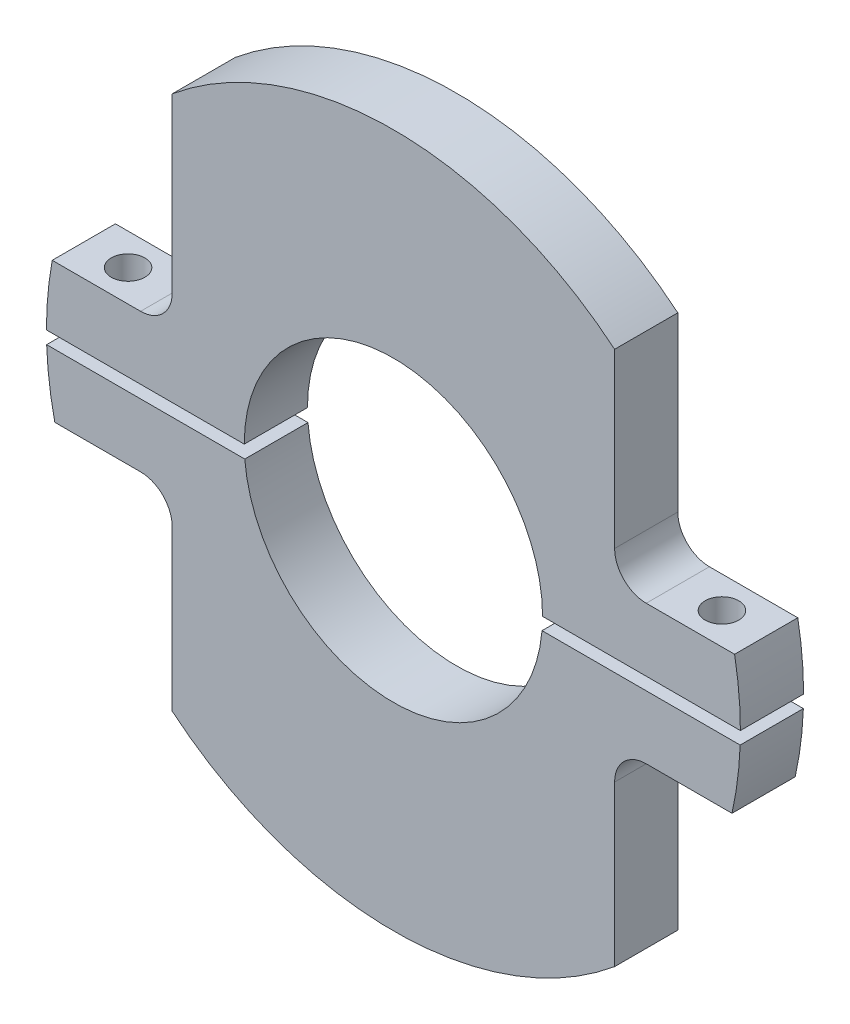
ISO-10303-21;
HEADER;
FILE_DESCRIPTION(('STEP AP214'),'2;1');
FILE_NAME('part.step','',(''),(''),'','','');
FILE_SCHEMA(('AUTOMOTIVE_DESIGN { 1 0 10303 214 1 1 1 1 }'));
ENDSEC;
DATA;
#1=APPLICATION_CONTEXT('core data for automotive mechanical design processes');
#2=APPLICATION_PROTOCOL_DEFINITION('international standard','automotive_design',2000,#1);
#3=PRODUCT_CONTEXT('',#1,'mechanical');
#4=PRODUCT('Part','Part','',(#3));
#5=PRODUCT_RELATED_PRODUCT_CATEGORY('part','',(#4));
#6=PRODUCT_DEFINITION_FORMATION('','',#4);
#7=PRODUCT_DEFINITION_CONTEXT('part definition',#1,'design');
#8=PRODUCT_DEFINITION('design','',#6,#7);
#9=PRODUCT_DEFINITION_SHAPE('','',#8);
#10=(LENGTH_UNIT() NAMED_UNIT(*) SI_UNIT(.MILLI.,.METRE.));
#11=(NAMED_UNIT(*) PLANE_ANGLE_UNIT() SI_UNIT($,.RADIAN.));
#12=(NAMED_UNIT(*) SI_UNIT($,.STERADIAN.) SOLID_ANGLE_UNIT());
#13=UNCERTAINTY_MEASURE_WITH_UNIT(LENGTH_MEASURE(1.E-05),#10,'distance_accuracy_value','');
#14=(GEOMETRIC_REPRESENTATION_CONTEXT(3) GLOBAL_UNCERTAINTY_ASSIGNED_CONTEXT((#13)) GLOBAL_UNIT_ASSIGNED_CONTEXT((#10,
#11,#12)) REPRESENTATION_CONTEXT('',''));
#15=CARTESIAN_POINT('',(0.,0.,0.));
#16=DIRECTION('',(0.,0.,1.));
#17=DIRECTION('',(1.,0.,0.));
#18=AXIS2_PLACEMENT_3D('',#15,#16,#17);
#19=CARTESIAN_POINT('',(0.,0.,12.7));
#20=DIRECTION('',(0.,0.,1.));
#21=DIRECTION('',(1.,0.,0.));
#22=AXIS2_PLACEMENT_3D('',#19,#20,#21);
#23=PLANE('',#22);
#24=DIRECTION('',(-1.,0.,0.));
#25=VECTOR('',#24,1.);
#26=CARTESIAN_POINT('',(-79.2624113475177,0.,12.7));
#27=LINE('',#26,#25);
#28=CARTESIAN_POINT('',(69.723,0.,12.7));
#29=VERTEX_POINT('',#28);
#30=CARTESIAN_POINT('',(29.972,0.,12.7));
#31=VERTEX_POINT('',#30);
#32=EDGE_CURVE('E187',#29,#31,#27,.T.);
#33=ORIENTED_EDGE('',*,*,#32,.F.);
#34=CARTESIAN_POINT('',(0.,0.,12.7));
#35=DIRECTION('',(0.,0.,1.));
#36=DIRECTION('',(1.,0.,0.));
#37=AXIS2_PLACEMENT_3D('',#34,#35,#36);
#38=CIRCLE('',#37,69.723);
#39=CARTESIAN_POINT('',(68.5565950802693,12.7,12.7));
#40=VERTEX_POINT('',#39);
#41=EDGE_CURVE('E223',#29,#40,#38,.T.);
#42=ORIENTED_EDGE('',*,*,#41,.T.);
#43=DIRECTION('',(1.,0.,0.));
#44=VECTOR('',#43,1.);
#45=CARTESIAN_POINT('',(89.9958628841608,12.7,12.7));
#46=LINE('',#45,#44);
#47=CARTESIAN_POINT('',(50.8,12.7,12.7));
#48=VERTEX_POINT('',#47);
#49=EDGE_CURVE('E198',#48,#40,#46,.T.);
#50=ORIENTED_EDGE('',*,*,#49,.F.);
#51=CARTESIAN_POINT('',(50.8,19.05,12.7));
#52=DIRECTION('',(0.,0.,1.));
#53=DIRECTION('',(1.,0.,0.));
#54=AXIS2_PLACEMENT_3D('',#51,#52,#53);
#55=CIRCLE('',#54,6.35);
#56=CARTESIAN_POINT('',(44.45,19.05,12.7));
#57=VERTEX_POINT('',#56);
#58=EDGE_CURVE('E53',#57,#48,#55,.T.);
#59=ORIENTED_EDGE('',*,*,#58,.F.);
#60=DIRECTION('',(0.,-1.,0.));
#61=VECTOR('',#60,1.);
#62=CARTESIAN_POINT('',(44.45,19.05,12.7));
#63=LINE('',#62,#61);
#64=CARTESIAN_POINT('',(44.45,53.716796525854,12.7));
#65=VERTEX_POINT('',#64);
#66=EDGE_CURVE('E215',#65,#57,#63,.T.);
#67=ORIENTED_EDGE('',*,*,#66,.F.);
#68=CARTESIAN_POINT('',(-44.45,53.716796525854,12.7));
#69=VERTEX_POINT('',#68);
#70=EDGE_CURVE('E225',#65,#69,#38,.T.);
#71=ORIENTED_EDGE('',*,*,#70,.T.);
#72=DIRECTION('',(0.,1.,0.));
#73=VECTOR('',#72,1.);
#74=CARTESIAN_POINT('',(-44.45,19.05,12.7));
#75=LINE('',#74,#73);
#76=CARTESIAN_POINT('',(-44.45,19.05,12.7));
#77=VERTEX_POINT('',#76);
#78=EDGE_CURVE('E195',#77,#69,#75,.T.);
#79=ORIENTED_EDGE('',*,*,#78,.F.);
#80=CARTESIAN_POINT('',(-50.8,19.05,12.7));
#81=DIRECTION('',(0.,0.,1.));
#82=DIRECTION('',(-1.,0.,0.));
#83=AXIS2_PLACEMENT_3D('',#80,#81,#82);
#84=CIRCLE('',#83,6.35);
#85=CARTESIAN_POINT('',(-50.8,12.7,12.7));
#86=VERTEX_POINT('',#85);
#87=EDGE_CURVE('E194',#86,#77,#84,.T.);
#88=ORIENTED_EDGE('',*,*,#87,.F.);
#89=DIRECTION('',(1.,0.,0.));
#90=VECTOR('',#89,1.);
#91=CARTESIAN_POINT('',(-79.2624113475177,12.7,12.7));
#92=LINE('',#91,#90);
#93=CARTESIAN_POINT('',(-68.5565950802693,12.7,12.7));
#94=VERTEX_POINT('',#93);
#95=EDGE_CURVE('E219',#94,#86,#92,.T.);
#96=ORIENTED_EDGE('',*,*,#95,.F.);
#97=CARTESIAN_POINT('',(-69.723,0.,12.7));
#98=VERTEX_POINT('',#97);
#99=EDGE_CURVE('E227',#94,#98,#38,.T.);
#100=ORIENTED_EDGE('',*,*,#99,.T.);
#101=CARTESIAN_POINT('',(-29.972,0.,12.7));
#102=VERTEX_POINT('',#101);
#103=EDGE_CURVE('E144',#102,#98,#27,.T.);
#104=ORIENTED_EDGE('',*,*,#103,.F.);
#105=CARTESIAN_POINT('',(0.,0.,12.7));
#106=DIRECTION('',(0.,0.,1.));
#107=DIRECTION('',(1.,0.,0.));
#108=AXIS2_PLACEMENT_3D('',#105,#106,#107);
#109=CIRCLE('',#108,29.972);
#110=EDGE_CURVE('E178',#31,#102,#109,.T.);
#111=ORIENTED_EDGE('',*,*,#110,.F.);
#112=EDGE_LOOP('',(#33,#42,#50,#59,#67,#71,#79,#88,#96,#100,#104,#111));
#113=FACE_BOUND('',#112,.T.);
#114=ADVANCED_FACE('F44',(#113),#23,.T.);
#115=CARTESIAN_POINT('',(0.,0.,0.));
#116=DIRECTION('',(0.,0.,1.));
#117=DIRECTION('',(1.,0.,0.));
#118=AXIS2_PLACEMENT_3D('',#115,#116,#117);
#119=PLANE('',#118);
#120=CARTESIAN_POINT('',(0.,0.,0.));
#121=DIRECTION('',(0.,0.,1.));
#122=DIRECTION('',(1.,0.,0.));
#123=AXIS2_PLACEMENT_3D('',#120,#121,#122);
#124=CIRCLE('',#123,69.723);
#125=CARTESIAN_POINT('',(69.723,0.,0.));
#126=VERTEX_POINT('',#125);
#127=CARTESIAN_POINT('',(68.5565950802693,12.7,0.));
#128=VERTEX_POINT('',#127);
#129=EDGE_CURVE('E165',#126,#128,#124,.T.);
#130=ORIENTED_EDGE('',*,*,#129,.F.);
#131=DIRECTION('',(-1.,0.,0.));
#132=VECTOR('',#131,1.);
#133=CARTESIAN_POINT('',(-79.2624113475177,0.,0.));
#134=LINE('',#133,#132);
#135=CARTESIAN_POINT('',(29.972,0.,0.));
#136=VERTEX_POINT('',#135);
#137=EDGE_CURVE('E110',#126,#136,#134,.T.);
#138=ORIENTED_EDGE('',*,*,#137,.T.);
#139=CARTESIAN_POINT('',(0.,0.,0.));
#140=DIRECTION('',(0.,0.,1.));
#141=DIRECTION('',(1.,0.,0.));
#142=AXIS2_PLACEMENT_3D('',#139,#140,#141);
#143=CIRCLE('',#142,29.972);
#144=CARTESIAN_POINT('',(-29.972,0.,0.));
#145=VERTEX_POINT('',#144);
#146=EDGE_CURVE('E47',#136,#145,#143,.T.);
#147=ORIENTED_EDGE('',*,*,#146,.T.);
#148=CARTESIAN_POINT('',(-69.723,0.,0.));
#149=VERTEX_POINT('',#148);
#150=EDGE_CURVE('E133',#145,#149,#134,.T.);
#151=ORIENTED_EDGE('',*,*,#150,.T.);
#152=CARTESIAN_POINT('',(-68.5565950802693,12.7,0.));
#153=VERTEX_POINT('',#152);
#154=EDGE_CURVE('E150',#153,#149,#124,.T.);
#155=ORIENTED_EDGE('',*,*,#154,.F.);
#156=DIRECTION('',(1.,0.,0.));
#157=VECTOR('',#156,1.);
#158=CARTESIAN_POINT('',(-79.2624113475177,12.7,0.));
#159=LINE('',#158,#157);
#160=CARTESIAN_POINT('',(-50.8,12.7,0.));
#161=VERTEX_POINT('',#160);
#162=EDGE_CURVE('E159',#153,#161,#159,.T.);
#163=ORIENTED_EDGE('',*,*,#162,.T.);
#164=CARTESIAN_POINT('',(-50.8,19.05,0.));
#165=DIRECTION('',(0.,0.,1.));
#166=DIRECTION('',(-1.,0.,0.));
#167=AXIS2_PLACEMENT_3D('',#164,#165,#166);
#168=CIRCLE('',#167,6.35);
#169=CARTESIAN_POINT('',(-44.45,19.05,0.));
#170=VERTEX_POINT('',#169);
#171=EDGE_CURVE('E210',#161,#170,#168,.T.);
#172=ORIENTED_EDGE('',*,*,#171,.T.);
#173=DIRECTION('',(0.,1.,0.));
#174=VECTOR('',#173,1.);
#175=CARTESIAN_POINT('',(-44.45,19.05,0.));
#176=LINE('',#175,#174);
#177=CARTESIAN_POINT('',(-44.45,53.716796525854,0.));
#178=VERTEX_POINT('',#177);
#179=EDGE_CURVE('E207',#170,#178,#176,.T.);
#180=ORIENTED_EDGE('',*,*,#179,.T.);
#181=CARTESIAN_POINT('',(44.45,53.716796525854,0.));
#182=VERTEX_POINT('',#181);
#183=EDGE_CURVE('E166',#182,#178,#124,.T.);
#184=ORIENTED_EDGE('',*,*,#183,.F.);
#185=DIRECTION('',(0.,-1.,0.));
#186=VECTOR('',#185,1.);
#187=CARTESIAN_POINT('',(44.45,19.05,0.));
#188=LINE('',#187,#186);
#189=CARTESIAN_POINT('',(44.45,19.05,0.));
#190=VERTEX_POINT('',#189);
#191=EDGE_CURVE('E204',#182,#190,#188,.T.);
#192=ORIENTED_EDGE('',*,*,#191,.T.);
#193=CARTESIAN_POINT('',(50.8,19.05,0.));
#194=DIRECTION('',(0.,0.,1.));
#195=DIRECTION('',(1.,0.,0.));
#196=AXIS2_PLACEMENT_3D('',#193,#194,#195);
#197=CIRCLE('',#196,6.35);
#198=CARTESIAN_POINT('',(50.8,12.7,0.));
#199=VERTEX_POINT('',#198);
#200=EDGE_CURVE('E201',#190,#199,#197,.T.);
#201=ORIENTED_EDGE('',*,*,#200,.T.);
#202=DIRECTION('',(1.,0.,0.));
#203=VECTOR('',#202,1.);
#204=CARTESIAN_POINT('',(89.9958628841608,12.7,0.));
#205=LINE('',#204,#203);
#206=EDGE_CURVE('E189',#199,#128,#205,.T.);
#207=ORIENTED_EDGE('',*,*,#206,.T.);
#208=EDGE_LOOP('',(#130,#138,#147,#151,#155,#163,#172,#180,#184,#192,#201,#207));
#209=FACE_BOUND('',#208,.T.);
#210=ADVANCED_FACE('F156',(#209),#119,.F.);
#211=CARTESIAN_POINT('',(0.,0.,12.7));
#212=DIRECTION('',(0.,0.,-1.));
#213=DIRECTION('',(-1.,0.,0.));
#214=AXIS2_PLACEMENT_3D('',#211,#212,#213);
#215=CYLINDRICAL_SURFACE('',#214,69.723);
#216=ORIENTED_EDGE('',*,*,#41,.F.);
#217=DIRECTION('',(0.,0.,-1.));
#218=VECTOR('',#217,1.);
#219=CARTESIAN_POINT('',(69.723,0.,12.7));
#220=LINE('',#219,#218);
#221=EDGE_CURVE('E104',#29,#126,#220,.T.);
#222=ORIENTED_EDGE('',*,*,#221,.T.);
#223=ORIENTED_EDGE('',*,*,#129,.T.);
#224=DIRECTION('',(0.,0.,-1.));
#225=VECTOR('',#224,1.);
#226=CARTESIAN_POINT('',(68.5565950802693,12.7,12.7));
#227=LINE('',#226,#225);
#228=EDGE_CURVE('E163',#128,#40,#227,.F.);
#229=ORIENTED_EDGE('',*,*,#228,.T.);
#230=EDGE_LOOP('',(#216,#222,#223,#229));
#231=FACE_BOUND('',#230,.T.);
#232=ADVANCED_FACE('F241',(#231),#215,.T.);
#233=ORIENTED_EDGE('',*,*,#154,.T.);
#234=DIRECTION('',(0.,0.,-1.));
#235=VECTOR('',#234,1.);
#236=CARTESIAN_POINT('',(-69.723,0.,12.7));
#237=LINE('',#236,#235);
#238=EDGE_CURVE('E142',#149,#98,#237,.F.);
#239=ORIENTED_EDGE('',*,*,#238,.T.);
#240=ORIENTED_EDGE('',*,*,#99,.F.);
#241=DIRECTION('',(0.,0.,-1.));
#242=VECTOR('',#241,1.);
#243=CARTESIAN_POINT('',(-68.5565950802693,12.7,12.7));
#244=LINE('',#243,#242);
#245=EDGE_CURVE('E149',#94,#153,#244,.T.);
#246=ORIENTED_EDGE('',*,*,#245,.T.);
#247=EDGE_LOOP('',(#233,#239,#240,#246));
#248=FACE_BOUND('',#247,.T.);
#249=ADVANCED_FACE('F162',(#248),#215,.T.);
#250=ORIENTED_EDGE('',*,*,#70,.F.);
#251=DIRECTION('',(0.,0.,-1.));
#252=VECTOR('',#251,1.);
#253=CARTESIAN_POINT('',(44.45,53.716796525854,12.7));
#254=LINE('',#253,#252);
#255=EDGE_CURVE('E173',#65,#182,#254,.T.);
#256=ORIENTED_EDGE('',*,*,#255,.T.);
#257=ORIENTED_EDGE('',*,*,#183,.T.);
#258=DIRECTION('',(0.,0.,-1.));
#259=VECTOR('',#258,1.);
#260=CARTESIAN_POINT('',(-44.45,53.716796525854,12.7));
#261=LINE('',#260,#259);
#262=EDGE_CURVE('E172',#178,#69,#261,.F.);
#263=ORIENTED_EDGE('',*,*,#262,.T.);
#264=EDGE_LOOP('',(#250,#256,#257,#263));
#265=FACE_BOUND('',#264,.T.);
#266=ADVANCED_FACE('F250',(#265),#215,.T.);
#267=CARTESIAN_POINT('',(0.,0.,12.7));
#268=DIRECTION('',(0.,0.,-1.));
#269=DIRECTION('',(-1.,0.,0.));
#270=AXIS2_PLACEMENT_3D('',#267,#268,#269);
#271=CYLINDRICAL_SURFACE('',#270,29.972);
#272=DIRECTION('',(0.,0.,-1.));
#273=VECTOR('',#272,1.);
#274=CARTESIAN_POINT('',(29.972,0.,12.7));
#275=LINE('',#274,#273);
#276=EDGE_CURVE('E185',#31,#136,#275,.T.);
#277=ORIENTED_EDGE('',*,*,#276,.F.);
#278=ORIENTED_EDGE('',*,*,#110,.T.);
#279=DIRECTION('',(0.,0.,-1.));
#280=VECTOR('',#279,1.);
#281=CARTESIAN_POINT('',(-29.972,0.,12.7));
#282=LINE('',#281,#280);
#283=EDGE_CURVE('E128',#145,#102,#282,.F.);
#284=ORIENTED_EDGE('',*,*,#283,.F.);
#285=ORIENTED_EDGE('',*,*,#146,.F.);
#286=EDGE_LOOP('',(#277,#278,#284,#285));
#287=FACE_BOUND('',#286,.T.);
#288=ADVANCED_FACE('F237',(#287),#271,.F.);
#289=CARTESIAN_POINT('',(-79.2624113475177,0.,0.));
#290=DIRECTION('',(0.,1.,0.));
#291=DIRECTION('',(0.,0.,1.));
#292=AXIS2_PLACEMENT_3D('',#289,#290,#291);
#293=PLANE('',#292);
#294=CARTESIAN_POINT('',(-59.6665950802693,0.,6.35));
#295=DIRECTION('',(0.,1.,0.));
#296=DIRECTION('',(0.,0.,1.));
#297=AXIS2_PLACEMENT_3D('',#294,#295,#296);
#298=CIRCLE('',#297,3.37819999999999);
#299=CARTESIAN_POINT('',(-59.6665950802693,0.,9.72819999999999));
#300=VERTEX_POINT('',#299);
#301=EDGE_CURVE('E226',#300,#300,#298,.T.);
#302=ORIENTED_EDGE('',*,*,#301,.T.);
#303=EDGE_LOOP('',(#302));
#304=FACE_BOUND('',#303,.T.);
#305=ORIENTED_EDGE('',*,*,#150,.F.);
#306=ORIENTED_EDGE('',*,*,#283,.T.);
#307=ORIENTED_EDGE('',*,*,#103,.T.);
#308=ORIENTED_EDGE('',*,*,#238,.F.);
#309=EDGE_LOOP('',(#305,#306,#307,#308));
#310=FACE_BOUND('',#309,.T.);
#311=ADVANCED_FACE('F143',(#304,#310),#293,.F.);
#312=CARTESIAN_POINT('',(59.6665950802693,0.,6.35));
#313=DIRECTION('',(0.,1.,0.));
#314=DIRECTION('',(0.,0.,1.));
#315=AXIS2_PLACEMENT_3D('',#312,#313,#314);
#316=CIRCLE('',#315,3.3782);
#317=CARTESIAN_POINT('',(59.6665950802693,0.,9.7282));
#318=VERTEX_POINT('',#317);
#319=EDGE_CURVE('E396',#318,#318,#316,.T.);
#320=ORIENTED_EDGE('',*,*,#319,.T.);
#321=EDGE_LOOP('',(#320));
#322=FACE_BOUND('',#321,.T.);
#323=ORIENTED_EDGE('',*,*,#32,.T.);
#324=ORIENTED_EDGE('',*,*,#276,.T.);
#325=ORIENTED_EDGE('',*,*,#137,.F.);
#326=ORIENTED_EDGE('',*,*,#221,.F.);
#327=EDGE_LOOP('',(#323,#324,#325,#326));
#328=FACE_BOUND('',#327,.T.);
#329=ADVANCED_FACE('F267',(#322,#328),#293,.F.);
#330=CARTESIAN_POINT('',(-44.45,19.05,0.));
#331=DIRECTION('',(1.,0.,0.));
#332=DIRECTION('',(0.,0.,-1.));
#333=AXIS2_PLACEMENT_3D('',#330,#331,#332);
#334=PLANE('',#333);
#335=ORIENTED_EDGE('',*,*,#179,.F.);
#336=DIRECTION('',(0.,0.,1.));
#337=VECTOR('',#336,1.);
#338=CARTESIAN_POINT('',(-44.45,19.05,0.));
#339=LINE('',#338,#337);
#340=EDGE_CURVE('E94',#170,#77,#339,.T.);
#341=ORIENTED_EDGE('',*,*,#340,.T.);
#342=ORIENTED_EDGE('',*,*,#78,.T.);
#343=ORIENTED_EDGE('',*,*,#262,.F.);
#344=EDGE_LOOP('',(#335,#341,#342,#343));
#345=FACE_BOUND('',#344,.T.);
#346=ADVANCED_FACE('F251',(#345),#334,.F.);
#347=CARTESIAN_POINT('',(-79.2624113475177,12.7,0.));
#348=DIRECTION('',(0.,-1.,0.));
#349=DIRECTION('',(0.,0.,-1.));
#350=AXIS2_PLACEMENT_3D('',#347,#348,#349);
#351=PLANE('',#350);
#352=CARTESIAN_POINT('',(-59.6665950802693,12.7,6.35));
#353=DIRECTION('',(0.,1.,0.));
#354=DIRECTION('',(0.,0.,1.));
#355=AXIS2_PLACEMENT_3D('',#352,#353,#354);
#356=CIRCLE('',#355,3.37819999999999);
#357=CARTESIAN_POINT('',(-59.6665950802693,12.7,9.72819999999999));
#358=VERTEX_POINT('',#357);
#359=EDGE_CURVE('E233',#358,#358,#356,.T.);
#360=ORIENTED_EDGE('',*,*,#359,.F.);
#361=EDGE_LOOP('',(#360));
#362=FACE_BOUND('',#361,.T.);
#363=ORIENTED_EDGE('',*,*,#95,.T.);
#364=DIRECTION('',(0.,0.,1.));
#365=VECTOR('',#364,1.);
#366=CARTESIAN_POINT('',(-50.8,12.7,0.));
#367=LINE('',#366,#365);
#368=EDGE_CURVE('E191',#161,#86,#367,.T.);
#369=ORIENTED_EDGE('',*,*,#368,.F.);
#370=ORIENTED_EDGE('',*,*,#162,.F.);
#371=ORIENTED_EDGE('',*,*,#245,.F.);
#372=EDGE_LOOP('',(#363,#369,#370,#371));
#373=FACE_BOUND('',#372,.T.);
#374=ADVANCED_FACE('F258',(#362,#373),#351,.F.);
#375=CARTESIAN_POINT('',(-50.8,19.05,0.));
#376=DIRECTION('',(0.,0.,1.));
#377=DIRECTION('',(1.,0.,0.));
#378=AXIS2_PLACEMENT_3D('',#375,#376,#377);
#379=CYLINDRICAL_SURFACE('',#378,6.35);
#380=ORIENTED_EDGE('',*,*,#87,.T.);
#381=ORIENTED_EDGE('',*,*,#340,.F.);
#382=ORIENTED_EDGE('',*,*,#171,.F.);
#383=ORIENTED_EDGE('',*,*,#368,.T.);
#384=EDGE_LOOP('',(#380,#381,#382,#383));
#385=FACE_BOUND('',#384,.T.);
#386=ADVANCED_FACE('F255',(#385),#379,.F.);
#387=CARTESIAN_POINT('',(89.9958628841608,12.7,0.));
#388=DIRECTION('',(0.,-1.,0.));
#389=DIRECTION('',(1.,0.,0.));
#390=AXIS2_PLACEMENT_3D('',#387,#388,#389);
#391=PLANE('',#390);
#392=CARTESIAN_POINT('',(59.6665950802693,12.7,6.35));
#393=DIRECTION('',(0.,1.,0.));
#394=DIRECTION('',(0.,0.,1.));
#395=AXIS2_PLACEMENT_3D('',#392,#393,#394);
#396=CIRCLE('',#395,3.3782);
#397=CARTESIAN_POINT('',(59.6665950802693,12.7,9.7282));
#398=VERTEX_POINT('',#397);
#399=EDGE_CURVE('E398',#398,#398,#396,.T.);
#400=ORIENTED_EDGE('',*,*,#399,.F.);
#401=EDGE_LOOP('',(#400));
#402=FACE_BOUND('',#401,.T.);
#403=ORIENTED_EDGE('',*,*,#206,.F.);
#404=DIRECTION('',(0.,0.,1.));
#405=VECTOR('',#404,1.);
#406=CARTESIAN_POINT('',(50.8,12.7,0.));
#407=LINE('',#406,#405);
#408=EDGE_CURVE('E62',#199,#48,#407,.T.);
#409=ORIENTED_EDGE('',*,*,#408,.T.);
#410=ORIENTED_EDGE('',*,*,#49,.T.);
#411=ORIENTED_EDGE('',*,*,#228,.F.);
#412=EDGE_LOOP('',(#403,#409,#410,#411));
#413=FACE_BOUND('',#412,.T.);
#414=ADVANCED_FACE('F243',(#402,#413),#391,.F.);
#415=CARTESIAN_POINT('',(44.45,19.05,0.));
#416=DIRECTION('',(-1.,0.,0.));
#417=DIRECTION('',(0.,0.,1.));
#418=AXIS2_PLACEMENT_3D('',#415,#416,#417);
#419=PLANE('',#418);
#420=ORIENTED_EDGE('',*,*,#66,.T.);
#421=DIRECTION('',(0.,0.,1.));
#422=VECTOR('',#421,1.);
#423=CARTESIAN_POINT('',(44.45,19.05,0.));
#424=LINE('',#423,#422);
#425=EDGE_CURVE('E12',#190,#57,#424,.T.);
#426=ORIENTED_EDGE('',*,*,#425,.F.);
#427=ORIENTED_EDGE('',*,*,#191,.F.);
#428=ORIENTED_EDGE('',*,*,#255,.F.);
#429=EDGE_LOOP('',(#420,#426,#427,#428));
#430=FACE_BOUND('',#429,.T.);
#431=ADVANCED_FACE('F284',(#430),#419,.F.);
#432=CARTESIAN_POINT('',(50.8,19.05,0.));
#433=DIRECTION('',(0.,0.,1.));
#434=DIRECTION('',(1.,0.,0.));
#435=AXIS2_PLACEMENT_3D('',#432,#433,#434);
#436=CYLINDRICAL_SURFACE('',#435,6.35);
#437=ORIENTED_EDGE('',*,*,#58,.T.);
#438=ORIENTED_EDGE('',*,*,#408,.F.);
#439=ORIENTED_EDGE('',*,*,#200,.F.);
#440=ORIENTED_EDGE('',*,*,#425,.T.);
#441=EDGE_LOOP('',(#437,#438,#439,#440));
#442=FACE_BOUND('',#441,.T.);
#443=ADVANCED_FACE('F245',(#442),#436,.F.);
#444=CARTESIAN_POINT('',(-59.6665950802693,-69.723,6.35));
#445=DIRECTION('',(0.,1.,0.));
#446=DIRECTION('',(0.,0.,1.));
#447=AXIS2_PLACEMENT_3D('',#444,#445,#446);
#448=CYLINDRICAL_SURFACE('',#447,3.37819999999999);
#449=ORIENTED_EDGE('',*,*,#359,.T.);
#450=EDGE_LOOP('',(#449));
#451=FACE_BOUND('',#450,.T.);
#452=ORIENTED_EDGE('',*,*,#301,.F.);
#453=EDGE_LOOP('',(#452));
#454=FACE_BOUND('',#453,.T.);
#455=ADVANCED_FACE('F288',(#451,#454),#448,.F.);
#456=CARTESIAN_POINT('',(59.6665950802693,-69.723,6.35));
#457=DIRECTION('',(0.,1.,0.));
#458=DIRECTION('',(0.,0.,1.));
#459=AXIS2_PLACEMENT_3D('',#456,#457,#458);
#460=CYLINDRICAL_SURFACE('',#459,3.3782);
#461=ORIENTED_EDGE('',*,*,#399,.T.);
#462=EDGE_LOOP('',(#461));
#463=FACE_BOUND('',#462,.T.);
#464=ORIENTED_EDGE('',*,*,#319,.F.);
#465=EDGE_LOOP('',(#464));
#466=FACE_BOUND('',#465,.T.);
#467=ADVANCED_FACE('F306',(#463,#466),#460,.F.);
#468=CLOSED_SHELL('',(#114,#210,#232,#249,#266,#288,#311,#329,#346,#374,#386,#414,#431,#443,
#455,#467));
#469=MANIFOLD_SOLID_BREP('B2',#468);
#470=CARTESIAN_POINT('',(0.,0.,12.7));
#471=DIRECTION('',(0.,0.,-1.));
#472=DIRECTION('',(-1.,0.,0.));
#473=AXIS2_PLACEMENT_3D('',#470,#471,#472);
#474=CYLINDRICAL_SURFACE('',#473,69.723);
#475=CARTESIAN_POINT('',(0.,0.,12.7));
#476=DIRECTION('',(0.,0.,1.));
#477=DIRECTION('',(1.,0.,0.));
#478=AXIS2_PLACEMENT_3D('',#475,#476,#477);
#479=CIRCLE('',#478,69.723);
#480=CARTESIAN_POINT('',(68.0370423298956,-15.24,12.7));
#481=VERTEX_POINT('',#480);
#482=CARTESIAN_POINT('',(69.6767187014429,-2.54,12.7));
#483=VERTEX_POINT('',#482);
#484=EDGE_CURVE('E574',#481,#483,#479,.T.);
#485=ORIENTED_EDGE('',*,*,#484,.F.);
#486=DIRECTION('',(0.,0.,-1.));
#487=VECTOR('',#486,1.);
#488=CARTESIAN_POINT('',(68.0370423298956,-15.24,12.7));
#489=LINE('',#488,#487);
#490=CARTESIAN_POINT('',(68.0370423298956,-15.24,0.));
#491=VERTEX_POINT('',#490);
#492=EDGE_CURVE('E416',#481,#491,#489,.T.);
#493=ORIENTED_EDGE('',*,*,#492,.T.);
#494=CARTESIAN_POINT('',(0.,0.,0.));
#495=DIRECTION('',(0.,0.,1.));
#496=DIRECTION('',(1.,0.,0.));
#497=AXIS2_PLACEMENT_3D('',#494,#495,#496);
#498=CIRCLE('',#497,69.723);
#499=CARTESIAN_POINT('',(69.6767187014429,-2.54,0.));
#500=VERTEX_POINT('',#499);
#501=EDGE_CURVE('E569',#491,#500,#498,.T.);
#502=ORIENTED_EDGE('',*,*,#501,.T.);
#503=DIRECTION('',(0.,0.,-1.));
#504=VECTOR('',#503,1.);
#505=CARTESIAN_POINT('',(69.6767187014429,-2.54,12.7));
#506=LINE('',#505,#504);
#507=EDGE_CURVE('E553',#500,#483,#506,.F.);
#508=ORIENTED_EDGE('',*,*,#507,.T.);
#509=EDGE_LOOP('',(#485,#493,#502,#508));
#510=FACE_BOUND('',#509,.T.);
#511=ADVANCED_FACE('F408',(#510),#474,.T.);
#512=CARTESIAN_POINT('',(0.,0.,12.7));
#513=DIRECTION('',(0.,0.,-1.));
#514=DIRECTION('',(-1.,0.,0.));
#515=AXIS2_PLACEMENT_3D('',#512,#513,#514);
#516=CYLINDRICAL_SURFACE('',#515,29.972);
#517=DIRECTION('',(0.,0.,-1.));
#518=VECTOR('',#517,1.);
#519=CARTESIAN_POINT('',(-29.8641789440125,-2.54,12.7));
#520=LINE('',#519,#518);
#521=CARTESIAN_POINT('',(-29.8641789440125,-2.54,12.7));
#522=VERTEX_POINT('',#521);
#523=CARTESIAN_POINT('',(-29.8641789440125,-2.54,0.));
#524=VERTEX_POINT('',#523);
#525=EDGE_CURVE('E581',#522,#524,#520,.T.);
#526=ORIENTED_EDGE('',*,*,#525,.F.);
#527=CARTESIAN_POINT('',(0.,0.,12.7));
#528=DIRECTION('',(0.,0.,1.));
#529=DIRECTION('',(1.,0.,0.));
#530=AXIS2_PLACEMENT_3D('',#527,#528,#529);
#531=CIRCLE('',#530,29.972);
#532=CARTESIAN_POINT('',(29.8641789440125,-2.54,12.7));
#533=VERTEX_POINT('',#532);
#534=EDGE_CURVE('E566',#522,#533,#531,.T.);
#535=ORIENTED_EDGE('',*,*,#534,.T.);
#536=DIRECTION('',(0.,0.,-1.));
#537=VECTOR('',#536,1.);
#538=CARTESIAN_POINT('',(29.8641789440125,-2.54,12.7));
#539=LINE('',#538,#537);
#540=CARTESIAN_POINT('',(29.8641789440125,-2.54,0.));
#541=VERTEX_POINT('',#540);
#542=EDGE_CURVE('E579',#541,#533,#539,.F.);
#543=ORIENTED_EDGE('',*,*,#542,.F.);
#544=CARTESIAN_POINT('',(0.,0.,0.));
#545=DIRECTION('',(0.,0.,1.));
#546=DIRECTION('',(1.,0.,0.));
#547=AXIS2_PLACEMENT_3D('',#544,#545,#546);
#548=CIRCLE('',#547,29.972);
#549=EDGE_CURVE('E563',#524,#541,#548,.T.);
#550=ORIENTED_EDGE('',*,*,#549,.F.);
#551=EDGE_LOOP('',(#526,#535,#543,#550));
#552=FACE_BOUND('',#551,.T.);
#553=ADVANCED_FACE('F614',(#552),#516,.F.);
#554=CARTESIAN_POINT('',(-69.6767187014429,-2.54,12.7));
#555=VERTEX_POINT('',#554);
#556=CARTESIAN_POINT('',(-68.0370423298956,-15.24,12.7));
#557=VERTEX_POINT('',#556);
#558=EDGE_CURVE('E578',#555,#557,#479,.T.);
#559=ORIENTED_EDGE('',*,*,#558,.F.);
#560=DIRECTION('',(0.,0.,-1.));
#561=VECTOR('',#560,1.);
#562=CARTESIAN_POINT('',(-69.6767187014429,-2.54,12.7));
#563=LINE('',#562,#561);
#564=CARTESIAN_POINT('',(-69.6767187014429,-2.54,0.));
#565=VERTEX_POINT('',#564);
#566=EDGE_CURVE('E560',#555,#565,#563,.T.);
#567=ORIENTED_EDGE('',*,*,#566,.T.);
#568=CARTESIAN_POINT('',(-68.0370423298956,-15.24,0.));
#569=VERTEX_POINT('',#568);
#570=EDGE_CURVE('E573',#565,#569,#498,.T.);
#571=ORIENTED_EDGE('',*,*,#570,.T.);
#572=DIRECTION('',(0.,0.,-1.));
#573=VECTOR('',#572,1.);
#574=CARTESIAN_POINT('',(-68.0370423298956,-15.24,12.7));
#575=LINE('',#574,#573);
#576=EDGE_CURVE('E584',#569,#557,#575,.F.);
#577=ORIENTED_EDGE('',*,*,#576,.T.);
#578=EDGE_LOOP('',(#559,#567,#571,#577));
#579=FACE_BOUND('',#578,.T.);
#580=ADVANCED_FACE('F617',(#579),#474,.T.);
#581=CARTESIAN_POINT('',(-44.45,-53.716796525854,0.));
#582=VERTEX_POINT('',#581);
#583=CARTESIAN_POINT('',(44.45,-53.716796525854,0.));
#584=VERTEX_POINT('',#583);
#585=EDGE_CURVE('E572',#582,#584,#498,.T.);
#586=ORIENTED_EDGE('',*,*,#585,.T.);
#587=DIRECTION('',(0.,0.,-1.));
#588=VECTOR('',#587,1.);
#589=CARTESIAN_POINT('',(44.45,-53.716796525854,12.7));
#590=LINE('',#589,#588);
#591=CARTESIAN_POINT('',(44.45,-53.716796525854,12.7));
#592=VERTEX_POINT('',#591);
#593=EDGE_CURVE('E42',#584,#592,#590,.F.);
#594=ORIENTED_EDGE('',*,*,#593,.T.);
#595=CARTESIAN_POINT('',(-44.45,-53.716796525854,12.7));
#596=VERTEX_POINT('',#595);
#597=EDGE_CURVE('E577',#596,#592,#479,.T.);
#598=ORIENTED_EDGE('',*,*,#597,.F.);
#599=DIRECTION('',(0.,0.,-1.));
#600=VECTOR('',#599,1.);
#601=CARTESIAN_POINT('',(-44.45,-53.716796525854,12.7));
#602=LINE('',#601,#600);
#603=EDGE_CURVE('E501',#596,#582,#602,.T.);
#604=ORIENTED_EDGE('',*,*,#603,.T.);
#605=EDGE_LOOP('',(#586,#594,#598,#604));
#606=FACE_BOUND('',#605,.T.);
#607=ADVANCED_FACE('F616',(#606),#474,.T.);
#608=CARTESIAN_POINT('',(0.,0.,0.));
#609=DIRECTION('',(0.,0.,1.));
#610=DIRECTION('',(1.,0.,0.));
#611=AXIS2_PLACEMENT_3D('',#608,#609,#610);
#612=PLANE('',#611);
#613=CARTESIAN_POINT('',(50.8,-21.59,0.));
#614=DIRECTION('',(0.,0.,1.));
#615=DIRECTION('',(1.,0.,0.));
#616=AXIS2_PLACEMENT_3D('',#613,#614,#615);
#617=CIRCLE('',#616,6.35);
#618=CARTESIAN_POINT('',(50.8,-15.24,0.));
#619=VERTEX_POINT('',#618);
#620=CARTESIAN_POINT('',(44.45,-21.59,0.));
#621=VERTEX_POINT('',#620);
#622=EDGE_CURVE('E546',#619,#621,#617,.T.);
#623=ORIENTED_EDGE('',*,*,#622,.T.);
#624=DIRECTION('',(0.,-1.,0.));
#625=VECTOR('',#624,1.);
#626=CARTESIAN_POINT('',(44.45,-54.6928639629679,0.));
#627=LINE('',#626,#625);
#628=EDGE_CURVE('E516',#621,#584,#627,.T.);
#629=ORIENTED_EDGE('',*,*,#628,.T.);
#630=ORIENTED_EDGE('',*,*,#585,.F.);
#631=DIRECTION('',(0.,1.,0.));
#632=VECTOR('',#631,1.);
#633=CARTESIAN_POINT('',(-44.45,-54.6928639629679,0.));
#634=LINE('',#633,#632);
#635=CARTESIAN_POINT('',(-44.45,-21.59,0.));
#636=VERTEX_POINT('',#635);
#637=EDGE_CURVE('E432',#582,#636,#634,.T.);
#638=ORIENTED_EDGE('',*,*,#637,.T.);
#639=CARTESIAN_POINT('',(-50.8,-21.59,0.));
#640=DIRECTION('',(0.,0.,1.));
#641=DIRECTION('',(-1.,0.,0.));
#642=AXIS2_PLACEMENT_3D('',#639,#640,#641);
#643=CIRCLE('',#642,6.35);
#644=CARTESIAN_POINT('',(-50.8,-15.24,0.));
#645=VERTEX_POINT('',#644);
#646=EDGE_CURVE('E514',#636,#645,#643,.T.);
#647=ORIENTED_EDGE('',*,*,#646,.T.);
#648=DIRECTION('',(-1.,0.,0.));
#649=VECTOR('',#648,1.);
#650=CARTESIAN_POINT('',(-50.8,-15.24,0.));
#651=LINE('',#650,#649);
#652=EDGE_CURVE('E538',#645,#569,#651,.T.);
#653=ORIENTED_EDGE('',*,*,#652,.T.);
#654=ORIENTED_EDGE('',*,*,#570,.F.);
#655=DIRECTION('',(1.,0.,0.));
#656=VECTOR('',#655,1.);
#657=CARTESIAN_POINT('',(-79.2624113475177,-2.54,0.));
#658=LINE('',#657,#656);
#659=EDGE_CURVE('E544',#565,#524,#658,.T.);
#660=ORIENTED_EDGE('',*,*,#659,.T.);
#661=ORIENTED_EDGE('',*,*,#549,.T.);
#662=EDGE_CURVE('E541',#541,#500,#658,.T.);
#663=ORIENTED_EDGE('',*,*,#662,.T.);
#664=ORIENTED_EDGE('',*,*,#501,.F.);
#665=DIRECTION('',(-1.,0.,0.));
#666=VECTOR('',#665,1.);
#667=CARTESIAN_POINT('',(50.8,-15.24,0.));
#668=LINE('',#667,#666);
#669=EDGE_CURVE('E424',#491,#619,#668,.T.);
#670=ORIENTED_EDGE('',*,*,#669,.T.);
#671=EDGE_LOOP('',(#623,#629,#630,#638,#647,#653,#654,#660,#661,#663,#664,#670));
#672=FACE_BOUND('',#671,.T.);
#673=ADVANCED_FACE('F625',(#672),#612,.F.);
#674=CARTESIAN_POINT('',(0.,0.,12.7));
#675=DIRECTION('',(0.,0.,1.));
#676=DIRECTION('',(1.,0.,0.));
#677=AXIS2_PLACEMENT_3D('',#674,#675,#676);
#678=PLANE('',#677);
#679=DIRECTION('',(0.,-1.,0.));
#680=VECTOR('',#679,1.);
#681=CARTESIAN_POINT('',(44.45,-54.6928639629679,12.7));
#682=LINE('',#681,#680);
#683=CARTESIAN_POINT('',(44.45,-21.59,12.7));
#684=VERTEX_POINT('',#683);
#685=EDGE_CURVE('E534',#684,#592,#682,.T.);
#686=ORIENTED_EDGE('',*,*,#685,.F.);
#687=CARTESIAN_POINT('',(50.8,-21.59,12.7));
#688=DIRECTION('',(0.,0.,1.));
#689=DIRECTION('',(1.,0.,0.));
#690=AXIS2_PLACEMENT_3D('',#687,#688,#689);
#691=CIRCLE('',#690,6.35);
#692=CARTESIAN_POINT('',(50.8,-15.24,12.7));
#693=VERTEX_POINT('',#692);
#694=EDGE_CURVE('E531',#693,#684,#691,.T.);
#695=ORIENTED_EDGE('',*,*,#694,.F.);
#696=DIRECTION('',(-1.,0.,0.));
#697=VECTOR('',#696,1.);
#698=CARTESIAN_POINT('',(50.8,-15.24,12.7));
#699=LINE('',#698,#697);
#700=EDGE_CURVE('E529',#481,#693,#699,.T.);
#701=ORIENTED_EDGE('',*,*,#700,.F.);
#702=ORIENTED_EDGE('',*,*,#484,.T.);
#703=DIRECTION('',(1.,0.,0.));
#704=VECTOR('',#703,1.);
#705=CARTESIAN_POINT('',(-79.2624113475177,-2.54,12.7));
#706=LINE('',#705,#704);
#707=EDGE_CURVE('E523',#533,#483,#706,.T.);
#708=ORIENTED_EDGE('',*,*,#707,.F.);
#709=ORIENTED_EDGE('',*,*,#534,.F.);
#710=EDGE_CURVE('E528',#555,#522,#706,.T.);
#711=ORIENTED_EDGE('',*,*,#710,.F.);
#712=ORIENTED_EDGE('',*,*,#558,.T.);
#713=DIRECTION('',(-1.,0.,0.));
#714=VECTOR('',#713,1.);
#715=CARTESIAN_POINT('',(-50.8,-15.24,12.7));
#716=LINE('',#715,#714);
#717=CARTESIAN_POINT('',(-50.8,-15.24,12.7));
#718=VERTEX_POINT('',#717);
#719=EDGE_CURVE('E521',#718,#557,#716,.T.);
#720=ORIENTED_EDGE('',*,*,#719,.F.);
#721=CARTESIAN_POINT('',(-50.8,-21.59,12.7));
#722=DIRECTION('',(0.,0.,1.));
#723=DIRECTION('',(-1.,0.,0.));
#724=AXIS2_PLACEMENT_3D('',#721,#722,#723);
#725=CIRCLE('',#724,6.35);
#726=CARTESIAN_POINT('',(-44.45,-21.59,12.7));
#727=VERTEX_POINT('',#726);
#728=EDGE_CURVE('E506',#727,#718,#725,.T.);
#729=ORIENTED_EDGE('',*,*,#728,.F.);
#730=DIRECTION('',(0.,1.,0.));
#731=VECTOR('',#730,1.);
#732=CARTESIAN_POINT('',(-44.45,-54.6928639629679,12.7));
#733=LINE('',#732,#731);
#734=EDGE_CURVE('E496',#596,#727,#733,.T.);
#735=ORIENTED_EDGE('',*,*,#734,.F.);
#736=ORIENTED_EDGE('',*,*,#597,.T.);
#737=EDGE_LOOP('',(#686,#695,#701,#702,#708,#709,#711,#712,#720,#729,#735,#736));
#738=FACE_BOUND('',#737,.T.);
#739=ADVANCED_FACE('F519',(#738),#678,.T.);
#740=CARTESIAN_POINT('',(-79.2624113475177,-2.54,0.));
#741=DIRECTION('',(0.,-1.,0.));
#742=DIRECTION('',(0.,0.,-1.));
#743=AXIS2_PLACEMENT_3D('',#740,#741,#742);
#744=PLANE('',#743);
#745=CARTESIAN_POINT('',(59.6665950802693,-2.54,6.35));
#746=DIRECTION('',(0.,-1.,0.));
#747=DIRECTION('',(0.,0.,-1.));
#748=AXIS2_PLACEMENT_3D('',#745,#746,#747);
#749=CIRCLE('',#748,3.3782);
#750=CARTESIAN_POINT('',(59.6665950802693,-2.54,2.9718));
#751=VERTEX_POINT('',#750);
#752=EDGE_CURVE('E589',#751,#751,#749,.T.);
#753=ORIENTED_EDGE('',*,*,#752,.T.);
#754=EDGE_LOOP('',(#753));
#755=FACE_BOUND('',#754,.T.);
#756=ORIENTED_EDGE('',*,*,#662,.F.);
#757=ORIENTED_EDGE('',*,*,#542,.T.);
#758=ORIENTED_EDGE('',*,*,#707,.T.);
#759=ORIENTED_EDGE('',*,*,#507,.F.);
#760=EDGE_LOOP('',(#756,#757,#758,#759));
#761=FACE_BOUND('',#760,.T.);
#762=ADVANCED_FACE('F648',(#755,#761),#744,.F.);
#763=CARTESIAN_POINT('',(-59.6665950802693,-2.54,6.35));
#764=DIRECTION('',(0.,-1.,0.));
#765=DIRECTION('',(0.,0.,-1.));
#766=AXIS2_PLACEMENT_3D('',#763,#764,#765);
#767=CIRCLE('',#766,3.37819999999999);
#768=CARTESIAN_POINT('',(-59.6665950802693,-2.54,2.97180000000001));
#769=VERTEX_POINT('',#768);
#770=EDGE_CURVE('E507',#769,#769,#767,.T.);
#771=ORIENTED_EDGE('',*,*,#770,.T.);
#772=EDGE_LOOP('',(#771));
#773=FACE_BOUND('',#772,.T.);
#774=ORIENTED_EDGE('',*,*,#710,.T.);
#775=ORIENTED_EDGE('',*,*,#525,.T.);
#776=ORIENTED_EDGE('',*,*,#659,.F.);
#777=ORIENTED_EDGE('',*,*,#566,.F.);
#778=EDGE_LOOP('',(#774,#775,#776,#777));
#779=FACE_BOUND('',#778,.T.);
#780=ADVANCED_FACE('F655',(#773,#779),#744,.F.);
#781=CARTESIAN_POINT('',(-50.8,-15.24,0.));
#782=DIRECTION('',(0.,1.,0.));
#783=DIRECTION('',(-1.,0.,0.));
#784=AXIS2_PLACEMENT_3D('',#781,#782,#783);
#785=PLANE('',#784);
#786=CARTESIAN_POINT('',(-59.6665950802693,-15.24,6.35));
#787=DIRECTION('',(0.,1.,0.));
#788=DIRECTION('',(-1.,0.,0.));
#789=AXIS2_PLACEMENT_3D('',#786,#787,#788);
#790=CIRCLE('',#789,3.37819999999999);
#791=CARTESIAN_POINT('',(-63.0447950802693,-15.24,6.35));
#792=VERTEX_POINT('',#791);
#793=EDGE_CURVE('E587',#792,#792,#790,.T.);
#794=ORIENTED_EDGE('',*,*,#793,.T.);
#795=EDGE_LOOP('',(#794));
#796=FACE_BOUND('',#795,.T.);
#797=ORIENTED_EDGE('',*,*,#652,.F.);
#798=DIRECTION('',(0.,0.,1.));
#799=VECTOR('',#798,1.);
#800=CARTESIAN_POINT('',(-50.8,-15.24,0.));
#801=LINE('',#800,#799);
#802=EDGE_CURVE('E515',#645,#718,#801,.T.);
#803=ORIENTED_EDGE('',*,*,#802,.T.);
#804=ORIENTED_EDGE('',*,*,#719,.T.);
#805=ORIENTED_EDGE('',*,*,#576,.F.);
#806=EDGE_LOOP('',(#797,#803,#804,#805));
#807=FACE_BOUND('',#806,.T.);
#808=ADVANCED_FACE('F657',(#796,#807),#785,.F.);
#809=CARTESIAN_POINT('',(-44.45,-54.6928639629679,0.));
#810=DIRECTION('',(1.,0.,0.));
#811=DIRECTION('',(0.,0.,-1.));
#812=AXIS2_PLACEMENT_3D('',#809,#810,#811);
#813=PLANE('',#812);
#814=ORIENTED_EDGE('',*,*,#734,.T.);
#815=DIRECTION('',(0.,0.,1.));
#816=VECTOR('',#815,1.);
#817=CARTESIAN_POINT('',(-44.45,-21.59,0.));
#818=LINE('',#817,#816);
#819=EDGE_CURVE('E499',#636,#727,#818,.T.);
#820=ORIENTED_EDGE('',*,*,#819,.F.);
#821=ORIENTED_EDGE('',*,*,#637,.F.);
#822=ORIENTED_EDGE('',*,*,#603,.F.);
#823=EDGE_LOOP('',(#814,#820,#821,#822));
#824=FACE_BOUND('',#823,.T.);
#825=ADVANCED_FACE('F498',(#824),#813,.F.);
#826=CARTESIAN_POINT('',(-50.8,-21.59,0.));
#827=DIRECTION('',(0.,0.,1.));
#828=DIRECTION('',(1.,0.,0.));
#829=AXIS2_PLACEMENT_3D('',#826,#827,#828);
#830=CYLINDRICAL_SURFACE('',#829,6.35);
#831=ORIENTED_EDGE('',*,*,#728,.T.);
#832=ORIENTED_EDGE('',*,*,#802,.F.);
#833=ORIENTED_EDGE('',*,*,#646,.F.);
#834=ORIENTED_EDGE('',*,*,#819,.T.);
#835=EDGE_LOOP('',(#831,#832,#833,#834));
#836=FACE_BOUND('',#835,.T.);
#837=ADVANCED_FACE('F511',(#836),#830,.F.);
#838=CARTESIAN_POINT('',(44.45,-54.6928639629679,0.));
#839=DIRECTION('',(-1.,0.,0.));
#840=DIRECTION('',(0.,0.,1.));
#841=AXIS2_PLACEMENT_3D('',#838,#839,#840);
#842=PLANE('',#841);
#843=ORIENTED_EDGE('',*,*,#628,.F.);
#844=DIRECTION('',(0.,0.,1.));
#845=VECTOR('',#844,1.);
#846=CARTESIAN_POINT('',(44.45,-21.59,0.));
#847=LINE('',#846,#845);
#848=EDGE_CURVE('E551',#621,#684,#847,.T.);
#849=ORIENTED_EDGE('',*,*,#848,.T.);
#850=ORIENTED_EDGE('',*,*,#685,.T.);
#851=ORIENTED_EDGE('',*,*,#593,.F.);
#852=EDGE_LOOP('',(#843,#849,#850,#851));
#853=FACE_BOUND('',#852,.T.);
#854=ADVANCED_FACE('F640',(#853),#842,.F.);
#855=CARTESIAN_POINT('',(50.8,-15.24,0.));
#856=DIRECTION('',(0.,1.,0.));
#857=DIRECTION('',(0.,0.,1.));
#858=AXIS2_PLACEMENT_3D('',#855,#856,#857);
#859=PLANE('',#858);
#860=CARTESIAN_POINT('',(59.6665950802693,-15.24,6.35));
#861=DIRECTION('',(0.,1.,0.));
#862=DIRECTION('',(0.,0.,1.));
#863=AXIS2_PLACEMENT_3D('',#860,#861,#862);
#864=CIRCLE('',#863,3.3782);
#865=CARTESIAN_POINT('',(59.6665950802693,-15.24,9.7282));
#866=VERTEX_POINT('',#865);
#867=EDGE_CURVE('E411',#866,#866,#864,.T.);
#868=ORIENTED_EDGE('',*,*,#867,.T.);
#869=EDGE_LOOP('',(#868));
#870=FACE_BOUND('',#869,.T.);
#871=ORIENTED_EDGE('',*,*,#700,.T.);
#872=DIRECTION('',(0.,0.,1.));
#873=VECTOR('',#872,1.);
#874=CARTESIAN_POINT('',(50.8,-15.24,0.));
#875=LINE('',#874,#873);
#876=EDGE_CURVE('E554',#619,#693,#875,.T.);
#877=ORIENTED_EDGE('',*,*,#876,.F.);
#878=ORIENTED_EDGE('',*,*,#669,.F.);
#879=ORIENTED_EDGE('',*,*,#492,.F.);
#880=EDGE_LOOP('',(#871,#877,#878,#879));
#881=FACE_BOUND('',#880,.T.);
#882=ADVANCED_FACE('F600',(#870,#881),#859,.F.);
#883=CARTESIAN_POINT('',(50.8,-21.59,0.));
#884=DIRECTION('',(0.,0.,1.));
#885=DIRECTION('',(1.,0.,0.));
#886=AXIS2_PLACEMENT_3D('',#883,#884,#885);
#887=CYLINDRICAL_SURFACE('',#886,6.35);
#888=ORIENTED_EDGE('',*,*,#694,.T.);
#889=ORIENTED_EDGE('',*,*,#848,.F.);
#890=ORIENTED_EDGE('',*,*,#622,.F.);
#891=ORIENTED_EDGE('',*,*,#876,.T.);
#892=EDGE_LOOP('',(#888,#889,#890,#891));
#893=FACE_BOUND('',#892,.T.);
#894=ADVANCED_FACE('F610',(#893),#887,.F.);
#895=CARTESIAN_POINT('',(-59.6665950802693,-69.723,6.35));
#896=DIRECTION('',(0.,1.,0.));
#897=DIRECTION('',(0.,0.,1.));
#898=AXIS2_PLACEMENT_3D('',#895,#896,#897);
#899=CYLINDRICAL_SURFACE('',#898,3.37819999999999);
#900=ORIENTED_EDGE('',*,*,#793,.F.);
#901=EDGE_LOOP('',(#900));
#902=FACE_BOUND('',#901,.T.);
#903=ORIENTED_EDGE('',*,*,#770,.F.);
#904=EDGE_LOOP('',(#903));
#905=FACE_BOUND('',#904,.T.);
#906=ADVANCED_FACE('F605',(#902,#905),#899,.F.);
#907=CARTESIAN_POINT('',(59.6665950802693,-69.723,6.35));
#908=DIRECTION('',(0.,1.,0.));
#909=DIRECTION('',(0.,0.,1.));
#910=AXIS2_PLACEMENT_3D('',#907,#908,#909);
#911=CYLINDRICAL_SURFACE('',#910,3.3782);
#912=ORIENTED_EDGE('',*,*,#867,.F.);
#913=EDGE_LOOP('',(#912));
#914=FACE_BOUND('',#913,.T.);
#915=ORIENTED_EDGE('',*,*,#752,.F.);
#916=EDGE_LOOP('',(#915));
#917=FACE_BOUND('',#916,.T.);
#918=ADVANCED_FACE('F602',(#914,#917),#911,.F.);
#919=CLOSED_SHELL('',(#511,#553,#580,#607,#673,#739,#762,#780,#808,#825,#837,#854,#882,#894,
#906,#918));
#920=MANIFOLD_SOLID_BREP('B6',#919);
#921=ADVANCED_BREP_SHAPE_REPRESENTATION('',(#18,#469,#920),#14);
#922=SHAPE_DEFINITION_REPRESENTATION(#9,#921);
ENDSEC;
END-ISO-10303-21;
